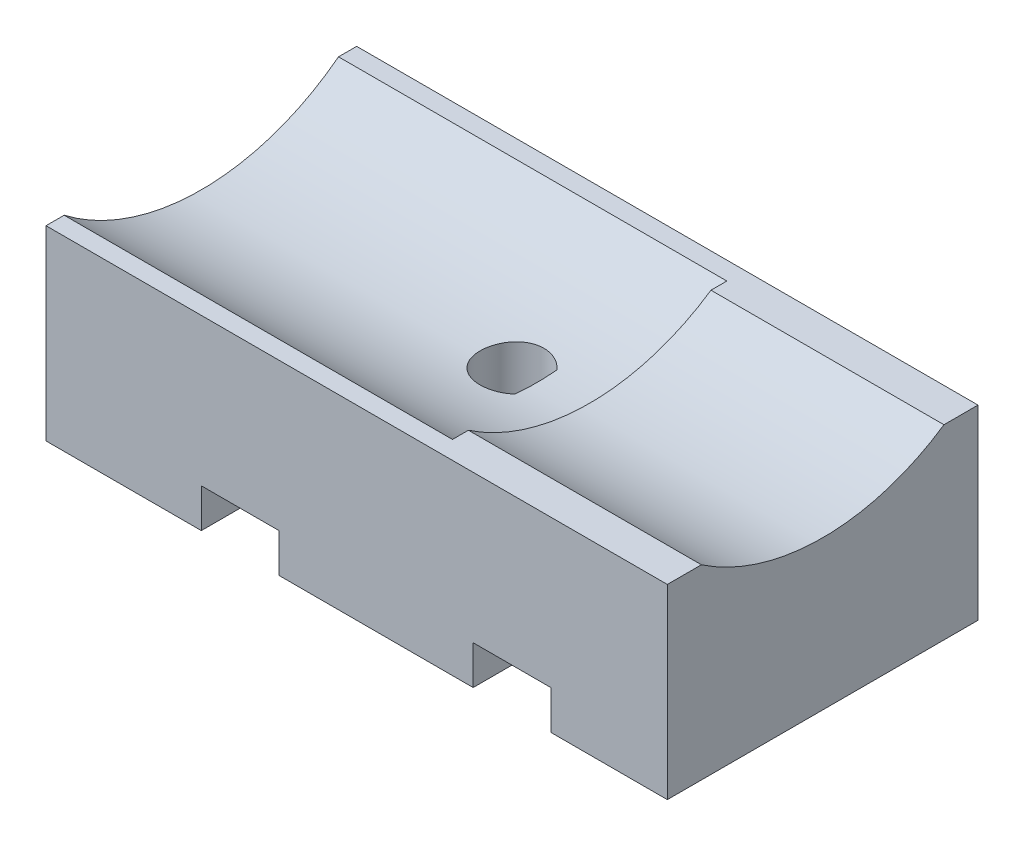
ISO-10303-21;
HEADER;
FILE_DESCRIPTION(('STEP AP214'),'2;1');
FILE_NAME('part.step','',(''),(''),'','','');
FILE_SCHEMA(('AUTOMOTIVE_DESIGN { 1 0 10303 214 1 1 1 1 }'));
ENDSEC;
DATA;
#1=APPLICATION_CONTEXT('core data for automotive mechanical design processes');
#2=APPLICATION_PROTOCOL_DEFINITION('international standard','automotive_design',2000,#1);
#3=PRODUCT_CONTEXT('',#1,'mechanical');
#4=PRODUCT('Part','Part','',(#3));
#5=PRODUCT_RELATED_PRODUCT_CATEGORY('part','',(#4));
#6=PRODUCT_DEFINITION_FORMATION('','',#4);
#7=PRODUCT_DEFINITION_CONTEXT('part definition',#1,'design');
#8=PRODUCT_DEFINITION('design','',#6,#7);
#9=PRODUCT_DEFINITION_SHAPE('','',#8);
#10=(LENGTH_UNIT() NAMED_UNIT(*) SI_UNIT(.MILLI.,.METRE.));
#11=(NAMED_UNIT(*) PLANE_ANGLE_UNIT() SI_UNIT($,.RADIAN.));
#12=(NAMED_UNIT(*) SI_UNIT($,.STERADIAN.) SOLID_ANGLE_UNIT());
#13=UNCERTAINTY_MEASURE_WITH_UNIT(LENGTH_MEASURE(1.E-05),#10,'distance_accuracy_value','');
#14=(GEOMETRIC_REPRESENTATION_CONTEXT(3) GLOBAL_UNCERTAINTY_ASSIGNED_CONTEXT((#13)) GLOBAL_UNIT_ASSIGNED_CONTEXT((#10,
#11,#12)) REPRESENTATION_CONTEXT('',''));
#15=CARTESIAN_POINT('',(0.,0.,0.));
#16=DIRECTION('',(0.,0.,1.));
#17=DIRECTION('',(1.,0.,0.));
#18=AXIS2_PLACEMENT_3D('',#15,#16,#17);
#19=CARTESIAN_POINT('',(-20.,12.,-10.));
#20=DIRECTION('',(0.,1.,0.));
#21=DIRECTION('',(-1.,0.,0.));
#22=AXIS2_PLACEMENT_3D('',#19,#20,#21);
#23=PLANE('',#22);
#24=DIRECTION('',(0.,0.,-1.));
#25=VECTOR('',#24,1.);
#26=CARTESIAN_POINT('',(5.,12.,-10.));
#27=LINE('',#26,#25);
#28=CARTESIAN_POINT('',(5.,12.,-7.80768851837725));
#29=VERTEX_POINT('',#28);
#30=CARTESIAN_POINT('',(5.,12.,-8.83176086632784));
#31=VERTEX_POINT('',#30);
#32=EDGE_CURVE('E328',#29,#31,#27,.T.);
#33=ORIENTED_EDGE('',*,*,#32,.F.);
#34=DIRECTION('',(-1.,0.,0.));
#35=VECTOR('',#34,1.);
#36=CARTESIAN_POINT('',(20.,12.,-7.80768851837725));
#37=LINE('',#36,#35);
#38=CARTESIAN_POINT('',(20.,12.,-7.80768851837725));
#39=VERTEX_POINT('',#38);
#40=EDGE_CURVE('E244',#29,#39,#37,.F.);
#41=ORIENTED_EDGE('',*,*,#40,.T.);
#42=DIRECTION('',(0.,0.,1.));
#43=VECTOR('',#42,1.);
#44=CARTESIAN_POINT('',(20.,12.,-10.));
#45=LINE('',#44,#43);
#46=CARTESIAN_POINT('',(20.,12.,-10.));
#47=VERTEX_POINT('',#46);
#48=EDGE_CURVE('E387',#47,#39,#45,.T.);
#49=ORIENTED_EDGE('',*,*,#48,.F.);
#50=DIRECTION('',(-1.,0.,0.));
#51=VECTOR('',#50,1.);
#52=CARTESIAN_POINT('',(-20.,12.,-10.));
#53=LINE('',#52,#51);
#54=CARTESIAN_POINT('',(-20.,12.,-10.));
#55=VERTEX_POINT('',#54);
#56=EDGE_CURVE('E384',#47,#55,#53,.T.);
#57=ORIENTED_EDGE('',*,*,#56,.T.);
#58=DIRECTION('',(0.,0.,1.));
#59=VECTOR('',#58,1.);
#60=CARTESIAN_POINT('',(-20.,12.,-10.));
#61=LINE('',#60,#59);
#62=CARTESIAN_POINT('',(-20.,12.,-8.83176086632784));
#63=VERTEX_POINT('',#62);
#64=EDGE_CURVE('E315',#55,#63,#61,.T.);
#65=ORIENTED_EDGE('',*,*,#64,.T.);
#66=DIRECTION('',(-1.,0.,0.));
#67=VECTOR('',#66,1.);
#68=CARTESIAN_POINT('',(5.,12.,-8.83176086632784));
#69=LINE('',#68,#67);
#70=EDGE_CURVE('E407',#63,#31,#69,.F.);
#71=ORIENTED_EDGE('',*,*,#70,.T.);
#72=EDGE_LOOP('',(#33,#41,#49,#57,#65,#71));
#73=FACE_BOUND('',#72,.T.);
#74=ADVANCED_FACE('F32',(#73),#23,.T.);
#75=CARTESIAN_POINT('',(20.,12.,7.80768851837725));
#76=VERTEX_POINT('',#75);
#77=CARTESIAN_POINT('',(20.,12.,10.));
#78=VERTEX_POINT('',#77);
#79=EDGE_CURVE('E389',#76,#78,#45,.T.);
#80=ORIENTED_EDGE('',*,*,#79,.F.);
#81=DIRECTION('',(-1.,0.,0.));
#82=VECTOR('',#81,1.);
#83=CARTESIAN_POINT('',(20.,12.,7.80768851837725));
#84=LINE('',#83,#82);
#85=CARTESIAN_POINT('',(5.,12.,7.80768851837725));
#86=VERTEX_POINT('',#85);
#87=EDGE_CURVE('E241',#76,#86,#84,.T.);
#88=ORIENTED_EDGE('',*,*,#87,.T.);
#89=CARTESIAN_POINT('',(5.,12.,8.83176086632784));
#90=VERTEX_POINT('',#89);
#91=EDGE_CURVE('E329',#90,#86,#27,.T.);
#92=ORIENTED_EDGE('',*,*,#91,.F.);
#93=DIRECTION('',(-1.,0.,0.));
#94=VECTOR('',#93,1.);
#95=CARTESIAN_POINT('',(5.,12.,8.83176086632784));
#96=LINE('',#95,#94);
#97=CARTESIAN_POINT('',(-20.,12.,8.83176086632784));
#98=VERTEX_POINT('',#97);
#99=EDGE_CURVE('E262',#90,#98,#96,.T.);
#100=ORIENTED_EDGE('',*,*,#99,.T.);
#101=CARTESIAN_POINT('',(-20.,12.,10.));
#102=VERTEX_POINT('',#101);
#103=EDGE_CURVE('E320',#98,#102,#61,.T.);
#104=ORIENTED_EDGE('',*,*,#103,.T.);
#105=DIRECTION('',(-1.,0.,0.));
#106=VECTOR('',#105,1.);
#107=CARTESIAN_POINT('',(-20.,12.,10.));
#108=LINE('',#107,#106);
#109=EDGE_CURVE('E370',#78,#102,#108,.T.);
#110=ORIENTED_EDGE('',*,*,#109,.F.);
#111=EDGE_LOOP('',(#80,#88,#92,#100,#104,#110));
#112=FACE_BOUND('',#111,.T.);
#113=ADVANCED_FACE('F285',(#112),#23,.T.);
#114=CARTESIAN_POINT('',(0.,12.,0.));
#115=DIRECTION('',(0.,-1.,0.));
#116=DIRECTION('',(0.,0.,-1.));
#117=AXIS2_PLACEMENT_3D('',#114,#115,#116);
#118=CYLINDRICAL_SURFACE('',#117,2.05);
#119=DIRECTION('',(0.,-1.,0.));
#120=VECTOR('',#119,1.);
#121=CARTESIAN_POINT('',(1.55,12.,-1.34164078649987));
#122=LINE('',#121,#120);
#123=CARTESIAN_POINT('',(1.55,9.06220238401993,-1.34164078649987));
#124=VERTEX_POINT('',#123);
#125=CARTESIAN_POINT('',(1.55,0.,-1.34164078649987));
#126=VERTEX_POINT('',#125);
#127=EDGE_CURVE('E405',#124,#126,#122,.T.);
#128=ORIENTED_EDGE('',*,*,#127,.F.);
#129=CARTESIAN_POINT('',(1.55,9.06220238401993,-1.34164078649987));
#130=CARTESIAN_POINT('',(1.51226440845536,9.06625320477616,-1.38523559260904));
#131=CARTESIAN_POINT('',(1.47271010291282,9.0703535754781,-1.42721478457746));
#132=CARTESIAN_POINT('',(1.39020905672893,9.07854062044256,-1.50769473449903));
#133=CARTESIAN_POINT('',(1.34726240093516,9.08262729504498,-1.54619557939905));
#134=CARTESIAN_POINT('',(1.21380729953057,9.09468805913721,-1.65602334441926));
#135=CARTESIAN_POINT('',(1.11859022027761,9.10247334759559,-1.7217833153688));
#136=CARTESIAN_POINT('',(0.918370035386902,9.11664398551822,-1.8364174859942));
#137=CARTESIAN_POINT('',(0.813361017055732,9.12302848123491,-1.88528139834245));
#138=CARTESIAN_POINT('',(0.596544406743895,9.13366215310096,-1.96467531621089));
#139=CARTESIAN_POINT('',(0.4847391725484,9.13791206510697,-1.99521164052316));
#140=CARTESIAN_POINT('',(0.258184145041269,9.14376739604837,-2.03691749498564));
#141=CARTESIAN_POINT('',(0.14345535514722,9.14538811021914,-2.0481990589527));
#142=CARTESIAN_POINT('',(-0.0862961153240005,9.14584550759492,-2.05140248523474));
#143=CARTESIAN_POINT('',(-0.201318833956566,9.14468180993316,-2.04332169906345));
#144=CARTESIAN_POINT('',(-0.427604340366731,9.1397206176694,-2.00815410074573));
#145=CARTESIAN_POINT('',(-0.538886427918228,9.13593996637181,-1.98118882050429));
#146=CARTESIAN_POINT('',(-0.755329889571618,9.12619309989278,-1.90918444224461));
#147=CARTESIAN_POINT('',(-0.860491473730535,9.12022695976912,-1.8641459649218));
#148=CARTESIAN_POINT('',(-1.06229658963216,9.10674550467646,-1.75702599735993));
#149=CARTESIAN_POINT('',(-1.15889578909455,9.09922273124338,-1.69486195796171));
#150=CARTESIAN_POINT('',(-1.34035120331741,9.08348670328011,-1.55533257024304));
#151=CARTESIAN_POINT('',(-1.42520650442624,9.07527339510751,-1.47796604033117));
#152=CARTESIAN_POINT('',(-1.5815075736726,9.05899729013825,-1.30944698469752));
#153=CARTESIAN_POINT('',(-1.65283379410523,9.05093635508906,-1.21818334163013));
#154=CARTESIAN_POINT('',(-1.77916145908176,9.03594220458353,-1.02489681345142));
#155=CARTESIAN_POINT('',(-1.83416312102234,9.02900897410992,-0.92287407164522));
#156=CARTESIAN_POINT('',(-1.92619905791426,9.0170565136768,-0.711040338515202));
#157=CARTESIAN_POINT('',(-1.96325203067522,9.01203529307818,-0.601237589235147));
#158=CARTESIAN_POINT('',(-2.01836546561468,9.0044646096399,-0.37688413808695));
#159=CARTESIAN_POINT('',(-2.03642707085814,9.00191499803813,-0.2623337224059));
#160=CARTESIAN_POINT('',(-2.05293570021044,8.99958697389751,-0.0328156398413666));
#161=CARTESIAN_POINT('',(-2.05155380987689,8.9997843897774,0.0821395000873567));
#162=CARTESIAN_POINT('',(-2.02963399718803,9.00286928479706,0.310169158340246));
#163=CARTESIAN_POINT('',(-2.00909641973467,9.00575671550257,0.423243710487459));
#164=CARTESIAN_POINT('',(-1.94956875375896,9.01388735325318,0.643981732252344));
#165=CARTESIAN_POINT('',(-1.91063193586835,9.01912375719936,0.751659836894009));
#166=CARTESIAN_POINT('',(-1.81545864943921,9.03137277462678,0.95896839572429));
#167=CARTESIAN_POINT('',(-1.75922136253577,9.03838547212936,1.05859846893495));
#168=CARTESIAN_POINT('',(-1.6305538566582,9.05347422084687,1.24778933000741));
#169=CARTESIAN_POINT('',(-1.55800642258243,9.06155778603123,1.33726979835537));
#170=CARTESIAN_POINT('',(-1.39897953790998,9.07785029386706,1.50284182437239));
#171=CARTESIAN_POINT('',(-1.31249942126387,9.08605924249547,1.57893274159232));
#172=CARTESIAN_POINT('',(-1.12739317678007,9.10173716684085,1.71605202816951));
#173=CARTESIAN_POINT('',(-1.02869292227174,9.10920107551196,1.77698097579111));
#174=CARTESIAN_POINT('',(-0.82235273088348,9.12247658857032,1.88138341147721));
#175=CARTESIAN_POINT('',(-0.714713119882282,9.12828825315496,1.92485753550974));
#176=CARTESIAN_POINT('',(-0.494062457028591,9.1375658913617,1.99290482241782));
#177=CARTESIAN_POINT('',(-0.381078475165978,9.14104256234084,2.0175642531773));
#178=CARTESIAN_POINT('',(-0.152529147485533,9.14528931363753,2.04756340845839));
#179=CARTESIAN_POINT('',(-0.0369640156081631,9.14605961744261,2.05290472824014));
#180=CARTESIAN_POINT('',(0.192407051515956,9.1448100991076,2.04414767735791));
#181=CARTESIAN_POINT('',(0.306219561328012,9.14281430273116,2.03021670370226));
#182=CARTESIAN_POINT('',(0.529894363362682,9.13630328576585,1.98362354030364));
#183=CARTESIAN_POINT('',(0.639755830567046,9.13178754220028,1.95095746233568));
#184=CARTESIAN_POINT('',(0.852561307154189,9.12074282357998,1.86781061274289));
#185=CARTESIAN_POINT('',(0.95549551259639,9.11421106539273,1.81730519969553));
#186=CARTESIAN_POINT('',(1.15140181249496,9.09987195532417,1.69993572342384));
#187=CARTESIAN_POINT('',(1.24438390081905,9.09206590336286,1.63308829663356));
#188=CARTESIAN_POINT('',(1.37027729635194,9.0804429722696,1.52561709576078));
#189=CARTESIAN_POINT('',(1.40819175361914,9.07678342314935,1.49068915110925));
#190=CARTESIAN_POINT('',(1.48121578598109,9.06947027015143,1.41814637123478));
#191=CARTESIAN_POINT('',(1.51633047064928,9.0658166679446,1.38053667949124));
#192=CARTESIAN_POINT('',(1.55,9.06220238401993,1.34164078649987));
#193=B_SPLINE_CURVE_WITH_KNOTS('',3,(#129,#130,#131,#132,#133,#134,#135,#136,#137,#138,#139,
#140,#141,#142,#143,#144,#145,#146,#147,#148,#149,#150,#151,#152,#153,#154,#155,#156,#157,#158,
#159,#160,#161,#162,#163,#164,#165,#166,#167,#168,#169,#170,#171,#172,#173,#174,#175,#176,#177,
#178,#179,#180,#181,#182,#183,#184,#185,#186,#187,#188,#189,#190,#191,#192),.UNSPECIFIED.,.F.,
.F.,(4,2,2,2,2,2,2,2,2,2,2,2,2,2,2,2,2,2,2,2,2,2,2,2,2,2,2,2,2,2,2,4),(0.,0.173295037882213,
0.346585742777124,0.692743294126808,1.03911123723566,1.38535969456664,1.72958654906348,
2.0738604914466,2.41593896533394,2.75800569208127,3.10175101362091,3.44552306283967,
3.79220411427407,4.13888054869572,4.48519505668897,4.83148871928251,5.17473722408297,
5.51797954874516,5.86023412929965,6.20250490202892,6.54731888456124,6.89214935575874,
7.23918469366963,7.58620738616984,7.93162920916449,8.27702250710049,8.61943452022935,
8.9619176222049,9.30487565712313,9.64748599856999,9.80240530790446,9.95703509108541),.UNSPECIFIED.);
#194=CARTESIAN_POINT('',(1.55,9.06220238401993,1.34164078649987));
#195=VERTEX_POINT('',#194);
#196=EDGE_CURVE('E253',#124,#195,#193,.T.);
#197=ORIENTED_EDGE('',*,*,#196,.T.);
#198=DIRECTION('',(0.,-1.,0.));
#199=VECTOR('',#198,1.);
#200=CARTESIAN_POINT('',(1.55,12.,1.34164078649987));
#201=LINE('',#200,#199);
#202=CARTESIAN_POINT('',(1.55,0.,1.34164078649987));
#203=VERTEX_POINT('',#202);
#204=EDGE_CURVE('E404',#195,#203,#201,.T.);
#205=ORIENTED_EDGE('',*,*,#204,.T.);
#206=CARTESIAN_POINT('',(0.,0.,0.));
#207=DIRECTION('',(0.,-1.,0.));
#208=DIRECTION('',(0.,0.,-1.));
#209=AXIS2_PLACEMENT_3D('',#206,#207,#208);
#210=CIRCLE('',#209,2.05);
#211=EDGE_CURVE('E314',#126,#203,#210,.F.);
#212=ORIENTED_EDGE('',*,*,#211,.F.);
#213=EDGE_LOOP('',(#128,#197,#205,#212));
#214=FACE_BOUND('',#213,.T.);
#215=ADVANCED_FACE('F264',(#214),#118,.F.);
#216=CARTESIAN_POINT('',(-20.,0.,-10.));
#217=DIRECTION('',(0.,-1.,0.));
#218=DIRECTION('',(1.,0.,0.));
#219=AXIS2_PLACEMENT_3D('',#216,#217,#218);
#220=PLANE('',#219);
#221=DIRECTION('',(0.,0.,1.));
#222=VECTOR('',#221,1.);
#223=CARTESIAN_POINT('',(12.5,0.,-10.));
#224=LINE('',#223,#222);
#225=CARTESIAN_POINT('',(12.5,0.,-10.));
#226=VERTEX_POINT('',#225);
#227=CARTESIAN_POINT('',(12.5,0.,-6.42261628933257));
#228=VERTEX_POINT('',#227);
#229=EDGE_CURVE('E210',#226,#228,#224,.T.);
#230=ORIENTED_EDGE('',*,*,#229,.F.);
#231=DIRECTION('',(1.,0.,0.));
#232=VECTOR('',#231,1.);
#233=CARTESIAN_POINT('',(-20.,0.,-10.));
#234=LINE('',#233,#232);
#235=CARTESIAN_POINT('',(20.,0.,-10.));
#236=VERTEX_POINT('',#235);
#237=EDGE_CURVE('E376',#226,#236,#234,.T.);
#238=ORIENTED_EDGE('',*,*,#237,.T.);
#239=DIRECTION('',(0.,0.,1.));
#240=VECTOR('',#239,1.);
#241=CARTESIAN_POINT('',(20.,0.,-10.));
#242=LINE('',#241,#240);
#243=CARTESIAN_POINT('',(20.,0.,10.));
#244=VERTEX_POINT('',#243);
#245=EDGE_CURVE('E390',#236,#244,#242,.T.);
#246=ORIENTED_EDGE('',*,*,#245,.T.);
#247=DIRECTION('',(1.,0.,0.));
#248=VECTOR('',#247,1.);
#249=CARTESIAN_POINT('',(-20.,0.,10.));
#250=LINE('',#249,#248);
#251=CARTESIAN_POINT('',(12.5,0.,10.));
#252=VERTEX_POINT('',#251);
#253=EDGE_CURVE('E360',#252,#244,#250,.T.);
#254=ORIENTED_EDGE('',*,*,#253,.F.);
#255=CARTESIAN_POINT('',(12.5,0.,6.42261628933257));
#256=VERTEX_POINT('',#255);
#257=EDGE_CURVE('E208',#256,#252,#224,.T.);
#258=ORIENTED_EDGE('',*,*,#257,.F.);
#259=DIRECTION('',(-1.,0.,0.));
#260=VECTOR('',#259,1.);
#261=CARTESIAN_POINT('',(12.5,0.,6.42261628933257));
#262=LINE('',#261,#260);
#263=CARTESIAN_POINT('',(7.49999999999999,0.,6.42261628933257));
#264=VERTEX_POINT('',#263);
#265=EDGE_CURVE('E202',#256,#264,#262,.T.);
#266=ORIENTED_EDGE('',*,*,#265,.T.);
#267=DIRECTION('',(0.,0.,1.));
#268=VECTOR('',#267,1.);
#269=CARTESIAN_POINT('',(7.49999999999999,0.,-10.));
#270=LINE('',#269,#268);
#271=CARTESIAN_POINT('',(7.49999999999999,0.,10.));
#272=VERTEX_POINT('',#271);
#273=EDGE_CURVE('E186',#264,#272,#270,.T.);
#274=ORIENTED_EDGE('',*,*,#273,.T.);
#275=CARTESIAN_POINT('',(-5.00000000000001,0.,10.));
#276=VERTEX_POINT('',#275);
#277=EDGE_CURVE('E357',#276,#272,#250,.T.);
#278=ORIENTED_EDGE('',*,*,#277,.F.);
#279=DIRECTION('',(0.,0.,-1.));
#280=VECTOR('',#279,1.);
#281=CARTESIAN_POINT('',(-5.,0.,-10.));
#282=LINE('',#281,#280);
#283=CARTESIAN_POINT('',(-5.,0.,6.42261628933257));
#284=VERTEX_POINT('',#283);
#285=EDGE_CURVE('E220',#276,#284,#282,.T.);
#286=ORIENTED_EDGE('',*,*,#285,.T.);
#287=DIRECTION('',(1.,0.,0.));
#288=VECTOR('',#287,1.);
#289=CARTESIAN_POINT('',(-10.,0.,6.42261628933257));
#290=LINE('',#289,#288);
#291=CARTESIAN_POINT('',(-10.,0.,6.42261628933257));
#292=VERTEX_POINT('',#291);
#293=EDGE_CURVE('E229',#292,#284,#290,.T.);
#294=ORIENTED_EDGE('',*,*,#293,.F.);
#295=DIRECTION('',(0.,0.,-1.));
#296=VECTOR('',#295,1.);
#297=CARTESIAN_POINT('',(-10.,0.,-10.));
#298=LINE('',#297,#296);
#299=CARTESIAN_POINT('',(-10.,0.,10.));
#300=VERTEX_POINT('',#299);
#301=EDGE_CURVE('E233',#300,#292,#298,.T.);
#302=ORIENTED_EDGE('',*,*,#301,.F.);
#303=CARTESIAN_POINT('',(-20.,0.,10.));
#304=VERTEX_POINT('',#303);
#305=EDGE_CURVE('E359',#304,#300,#250,.T.);
#306=ORIENTED_EDGE('',*,*,#305,.F.);
#307=DIRECTION('',(0.,0.,1.));
#308=VECTOR('',#307,1.);
#309=CARTESIAN_POINT('',(-20.,0.,-10.));
#310=LINE('',#309,#308);
#311=CARTESIAN_POINT('',(-20.,0.,-10.));
#312=VERTEX_POINT('',#311);
#313=EDGE_CURVE('E323',#312,#304,#310,.T.);
#314=ORIENTED_EDGE('',*,*,#313,.F.);
#315=CARTESIAN_POINT('',(-10.,0.,-10.));
#316=VERTEX_POINT('',#315);
#317=EDGE_CURVE('E377',#312,#316,#234,.T.);
#318=ORIENTED_EDGE('',*,*,#317,.T.);
#319=CARTESIAN_POINT('',(-10.,0.,-6.42261628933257));
#320=VERTEX_POINT('',#319);
#321=EDGE_CURVE('E236',#320,#316,#298,.T.);
#322=ORIENTED_EDGE('',*,*,#321,.F.);
#323=DIRECTION('',(1.,0.,0.));
#324=VECTOR('',#323,1.);
#325=CARTESIAN_POINT('',(-10.,0.,-6.42261628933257));
#326=LINE('',#325,#324);
#327=CARTESIAN_POINT('',(-5.,0.,-6.42261628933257));
#328=VERTEX_POINT('',#327);
#329=EDGE_CURVE('E231',#328,#320,#326,.F.);
#330=ORIENTED_EDGE('',*,*,#329,.F.);
#331=CARTESIAN_POINT('',(-5.,0.,-10.));
#332=VERTEX_POINT('',#331);
#333=EDGE_CURVE('E224',#328,#332,#282,.T.);
#334=ORIENTED_EDGE('',*,*,#333,.T.);
#335=CARTESIAN_POINT('',(7.49999999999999,0.,-10.));
#336=VERTEX_POINT('',#335);
#337=EDGE_CURVE('E381',#332,#336,#234,.T.);
#338=ORIENTED_EDGE('',*,*,#337,.T.);
#339=CARTESIAN_POINT('',(7.49999999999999,0.,-6.42261628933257));
#340=VERTEX_POINT('',#339);
#341=EDGE_CURVE('E47',#336,#340,#270,.T.);
#342=ORIENTED_EDGE('',*,*,#341,.T.);
#343=DIRECTION('',(-1.,0.,0.));
#344=VECTOR('',#343,1.);
#345=CARTESIAN_POINT('',(12.5,0.,-6.42261628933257));
#346=LINE('',#345,#344);
#347=EDGE_CURVE('E194',#340,#228,#346,.F.);
#348=ORIENTED_EDGE('',*,*,#347,.T.);
#349=EDGE_LOOP('',(#230,#238,#246,#254,#258,#266,#274,#278,#286,#294,#302,#306,#314,#318,#322,
#330,#334,#338,#342,#348));
#350=FACE_BOUND('',#349,.T.);
#351=DIRECTION('',(0.,0.,1.));
#352=VECTOR('',#351,1.);
#353=CARTESIAN_POINT('',(1.55,0.,-10.));
#354=LINE('',#353,#352);
#355=EDGE_CURVE('E312',#203,#126,#354,.F.);
#356=ORIENTED_EDGE('',*,*,#355,.T.);
#357=ORIENTED_EDGE('',*,*,#211,.T.);
#358=EDGE_LOOP('',(#356,#357));
#359=FACE_BOUND('',#358,.T.);
#360=ADVANCED_FACE('F298',(#350,#359),#220,.T.);
#361=CARTESIAN_POINT('',(-20.,12.,-10.));
#362=DIRECTION('',(-1.,0.,0.));
#363=DIRECTION('',(0.,0.,1.));
#364=AXIS2_PLACEMENT_3D('',#361,#362,#363);
#365=PLANE('',#364);
#366=ORIENTED_EDGE('',*,*,#103,.F.);
#367=CARTESIAN_POINT('',(-20.,23.5,0.));
#368=DIRECTION('',(1.,0.,0.));
#369=DIRECTION('',(0.,0.,-1.));
#370=AXIS2_PLACEMENT_3D('',#367,#368,#369);
#371=CIRCLE('',#370,14.5);
#372=EDGE_CURVE('E247',#98,#63,#371,.T.);
#373=ORIENTED_EDGE('',*,*,#372,.T.);
#374=ORIENTED_EDGE('',*,*,#64,.F.);
#375=DIRECTION('',(0.,-1.,0.));
#376=VECTOR('',#375,1.);
#377=CARTESIAN_POINT('',(-20.,12.,-10.));
#378=LINE('',#377,#376);
#379=EDGE_CURVE('E373',#55,#312,#378,.T.);
#380=ORIENTED_EDGE('',*,*,#379,.T.);
#381=ORIENTED_EDGE('',*,*,#313,.T.);
#382=DIRECTION('',(0.,-1.,0.));
#383=VECTOR('',#382,1.);
#384=CARTESIAN_POINT('',(-20.,12.,10.));
#385=LINE('',#384,#383);
#386=EDGE_CURVE('E364',#102,#304,#385,.T.);
#387=ORIENTED_EDGE('',*,*,#386,.F.);
#388=EDGE_LOOP('',(#366,#373,#374,#380,#381,#387));
#389=FACE_BOUND('',#388,.T.);
#390=ADVANCED_FACE('F34',(#389),#365,.T.);
#391=CARTESIAN_POINT('',(20.,12.,-10.));
#392=DIRECTION('',(1.,0.,0.));
#393=DIRECTION('',(0.,1.,0.));
#394=AXIS2_PLACEMENT_3D('',#391,#392,#393);
#395=PLANE('',#394);
#396=ORIENTED_EDGE('',*,*,#48,.T.);
#397=CARTESIAN_POINT('',(20.,23.5,0.));
#398=DIRECTION('',(1.,0.,0.));
#399=DIRECTION('',(0.,0.,-1.));
#400=AXIS2_PLACEMENT_3D('',#397,#398,#399);
#401=CIRCLE('',#400,13.9);
#402=EDGE_CURVE('E239',#76,#39,#401,.T.);
#403=ORIENTED_EDGE('',*,*,#402,.F.);
#404=ORIENTED_EDGE('',*,*,#79,.T.);
#405=DIRECTION('',(0.,1.,0.));
#406=VECTOR('',#405,1.);
#407=CARTESIAN_POINT('',(20.,12.,10.));
#408=LINE('',#407,#406);
#409=EDGE_CURVE('E363',#244,#78,#408,.T.);
#410=ORIENTED_EDGE('',*,*,#409,.F.);
#411=ORIENTED_EDGE('',*,*,#245,.F.);
#412=DIRECTION('',(0.,1.,0.));
#413=VECTOR('',#412,1.);
#414=CARTESIAN_POINT('',(20.,12.,-10.));
#415=LINE('',#414,#413);
#416=EDGE_CURVE('E380',#236,#47,#415,.T.);
#417=ORIENTED_EDGE('',*,*,#416,.T.);
#418=EDGE_LOOP('',(#396,#403,#404,#410,#411,#417));
#419=FACE_BOUND('',#418,.T.);
#420=ADVANCED_FACE('F295',(#419),#395,.T.);
#421=CARTESIAN_POINT('',(0.,0.,-10.));
#422=DIRECTION('',(0.,0.,1.));
#423=DIRECTION('',(1.,0.,0.));
#424=AXIS2_PLACEMENT_3D('',#421,#422,#423);
#425=PLANE('',#424);
#426=ORIENTED_EDGE('',*,*,#237,.F.);
#427=DIRECTION('',(0.,1.,0.));
#428=VECTOR('',#427,1.);
#429=CARTESIAN_POINT('',(12.5,0.,-10.));
#430=LINE('',#429,#428);
#431=CARTESIAN_POINT('',(12.5,2.5,-10.));
#432=VERTEX_POINT('',#431);
#433=EDGE_CURVE('E200',#226,#432,#430,.T.);
#434=ORIENTED_EDGE('',*,*,#433,.T.);
#435=DIRECTION('',(-1.,0.,0.));
#436=VECTOR('',#435,1.);
#437=CARTESIAN_POINT('',(12.5,2.5,-10.));
#438=LINE('',#437,#436);
#439=CARTESIAN_POINT('',(7.49999999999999,2.5,-10.));
#440=VERTEX_POINT('',#439);
#441=EDGE_CURVE('E191',#440,#432,#438,.F.);
#442=ORIENTED_EDGE('',*,*,#441,.F.);
#443=DIRECTION('',(0.,1.,0.));
#444=VECTOR('',#443,1.);
#445=CARTESIAN_POINT('',(7.49999999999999,0.,-10.));
#446=LINE('',#445,#444);
#447=EDGE_CURVE('E178',#336,#440,#446,.T.);
#448=ORIENTED_EDGE('',*,*,#447,.F.);
#449=ORIENTED_EDGE('',*,*,#337,.F.);
#450=DIRECTION('',(0.,-1.,0.));
#451=VECTOR('',#450,1.);
#452=CARTESIAN_POINT('',(-5.,0.,-10.));
#453=LINE('',#452,#451);
#454=CARTESIAN_POINT('',(-5.,2.5,-10.));
#455=VERTEX_POINT('',#454);
#456=EDGE_CURVE('E223',#455,#332,#453,.T.);
#457=ORIENTED_EDGE('',*,*,#456,.F.);
#458=DIRECTION('',(1.,0.,0.));
#459=VECTOR('',#458,1.);
#460=CARTESIAN_POINT('',(-10.,2.5,-10.));
#461=LINE('',#460,#459);
#462=CARTESIAN_POINT('',(-10.,2.5,-10.));
#463=VERTEX_POINT('',#462);
#464=EDGE_CURVE('E226',#455,#463,#461,.F.);
#465=ORIENTED_EDGE('',*,*,#464,.T.);
#466=DIRECTION('',(0.,-1.,0.));
#467=VECTOR('',#466,1.);
#468=CARTESIAN_POINT('',(-10.,0.,-10.));
#469=LINE('',#468,#467);
#470=EDGE_CURVE('E235',#463,#316,#469,.T.);
#471=ORIENTED_EDGE('',*,*,#470,.T.);
#472=ORIENTED_EDGE('',*,*,#317,.F.);
#473=ORIENTED_EDGE('',*,*,#379,.F.);
#474=ORIENTED_EDGE('',*,*,#56,.F.);
#475=ORIENTED_EDGE('',*,*,#416,.F.);
#476=EDGE_LOOP('',(#426,#434,#442,#448,#449,#457,#465,#471,#472,#473,#474,#475));
#477=FACE_BOUND('',#476,.T.);
#478=ADVANCED_FACE('F199',(#477),#425,.F.);
#479=CARTESIAN_POINT('',(0.,0.,10.));
#480=DIRECTION('',(0.,0.,1.));
#481=DIRECTION('',(1.,0.,0.));
#482=AXIS2_PLACEMENT_3D('',#479,#480,#481);
#483=PLANE('',#482);
#484=DIRECTION('',(0.,1.,0.));
#485=VECTOR('',#484,1.);
#486=CARTESIAN_POINT('',(12.5,0.,10.));
#487=LINE('',#486,#485);
#488=CARTESIAN_POINT('',(12.5,2.5,10.));
#489=VERTEX_POINT('',#488);
#490=EDGE_CURVE('E11',#252,#489,#487,.T.);
#491=ORIENTED_EDGE('',*,*,#490,.F.);
#492=ORIENTED_EDGE('',*,*,#253,.T.);
#493=ORIENTED_EDGE('',*,*,#409,.T.);
#494=ORIENTED_EDGE('',*,*,#109,.T.);
#495=ORIENTED_EDGE('',*,*,#386,.T.);
#496=ORIENTED_EDGE('',*,*,#305,.T.);
#497=DIRECTION('',(0.,-1.,0.));
#498=VECTOR('',#497,1.);
#499=CARTESIAN_POINT('',(-10.,0.,10.));
#500=LINE('',#499,#498);
#501=CARTESIAN_POINT('',(-10.,2.5,10.));
#502=VERTEX_POINT('',#501);
#503=EDGE_CURVE('E339',#502,#300,#500,.T.);
#504=ORIENTED_EDGE('',*,*,#503,.F.);
#505=DIRECTION('',(1.,0.,0.));
#506=VECTOR('',#505,1.);
#507=CARTESIAN_POINT('',(-10.,2.5,10.));
#508=LINE('',#507,#506);
#509=CARTESIAN_POINT('',(-5.,2.5,10.));
#510=VERTEX_POINT('',#509);
#511=EDGE_CURVE('E337',#510,#502,#508,.F.);
#512=ORIENTED_EDGE('',*,*,#511,.F.);
#513=DIRECTION('',(0.,-1.,0.));
#514=VECTOR('',#513,1.);
#515=CARTESIAN_POINT('',(-5.,0.,10.));
#516=LINE('',#515,#514);
#517=EDGE_CURVE('E334',#510,#276,#516,.T.);
#518=ORIENTED_EDGE('',*,*,#517,.T.);
#519=ORIENTED_EDGE('',*,*,#277,.T.);
#520=DIRECTION('',(0.,1.,0.));
#521=VECTOR('',#520,1.);
#522=CARTESIAN_POINT('',(7.49999999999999,0.,10.));
#523=LINE('',#522,#521);
#524=CARTESIAN_POINT('',(7.49999999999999,2.5,10.));
#525=VERTEX_POINT('',#524);
#526=EDGE_CURVE('E341',#272,#525,#523,.T.);
#527=ORIENTED_EDGE('',*,*,#526,.T.);
#528=DIRECTION('',(-1.,0.,0.));
#529=VECTOR('',#528,1.);
#530=CARTESIAN_POINT('',(12.5,2.5,10.));
#531=LINE('',#530,#529);
#532=EDGE_CURVE('E40',#525,#489,#531,.F.);
#533=ORIENTED_EDGE('',*,*,#532,.T.);
#534=EDGE_LOOP('',(#491,#492,#493,#494,#495,#496,#504,#512,#518,#519,#527,#533));
#535=FACE_BOUND('',#534,.T.);
#536=ADVANCED_FACE('F277',(#535),#483,.T.);
#537=CARTESIAN_POINT('',(1.55,12.,-1.34164078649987));
#538=DIRECTION('',(-1.,0.,0.));
#539=DIRECTION('',(0.,0.,1.));
#540=AXIS2_PLACEMENT_3D('',#537,#538,#539);
#541=PLANE('',#540);
#542=ORIENTED_EDGE('',*,*,#204,.F.);
#543=CARTESIAN_POINT('',(1.55,23.5,0.));
#544=DIRECTION('',(-1.,0.,0.));
#545=DIRECTION('',(0.,0.,1.));
#546=AXIS2_PLACEMENT_3D('',#543,#544,#545);
#547=CIRCLE('',#546,14.5);
#548=EDGE_CURVE('E317',#195,#124,#547,.F.);
#549=ORIENTED_EDGE('',*,*,#548,.T.);
#550=ORIENTED_EDGE('',*,*,#127,.T.);
#551=ORIENTED_EDGE('',*,*,#355,.F.);
#552=EDGE_LOOP('',(#542,#549,#550,#551));
#553=FACE_BOUND('',#552,.T.);
#554=ADVANCED_FACE('F273',(#553),#541,.T.);
#555=CARTESIAN_POINT('',(5.,23.5,0.));
#556=DIRECTION('',(-1.,0.,0.));
#557=DIRECTION('',(0.,0.,1.));
#558=AXIS2_PLACEMENT_3D('',#555,#556,#557);
#559=CYLINDRICAL_SURFACE('',#558,14.5);
#560=ORIENTED_EDGE('',*,*,#548,.F.);
#561=ORIENTED_EDGE('',*,*,#196,.F.);
#562=EDGE_LOOP('',(#560,#561));
#563=FACE_BOUND('',#562,.T.);
#564=ORIENTED_EDGE('',*,*,#372,.F.);
#565=ORIENTED_EDGE('',*,*,#99,.F.);
#566=CARTESIAN_POINT('',(5.,23.5,0.));
#567=DIRECTION('',(1.,0.,0.));
#568=DIRECTION('',(0.,0.,-1.));
#569=AXIS2_PLACEMENT_3D('',#566,#567,#568);
#570=CIRCLE('',#569,14.5);
#571=EDGE_CURVE('E250',#90,#31,#570,.T.);
#572=ORIENTED_EDGE('',*,*,#571,.T.);
#573=ORIENTED_EDGE('',*,*,#70,.F.);
#574=EDGE_LOOP('',(#564,#565,#572,#573));
#575=FACE_BOUND('',#574,.T.);
#576=ADVANCED_FACE('F268',(#563,#575),#559,.F.);
#577=CARTESIAN_POINT('',(5.,23.5,0.));
#578=DIRECTION('',(1.,0.,0.));
#579=DIRECTION('',(0.,0.,-1.));
#580=AXIS2_PLACEMENT_3D('',#577,#578,#579);
#581=PLANE('',#580);
#582=CARTESIAN_POINT('',(5.,23.5,0.));
#583=DIRECTION('',(1.,0.,0.));
#584=DIRECTION('',(0.,0.,-1.));
#585=AXIS2_PLACEMENT_3D('',#582,#583,#584);
#586=CIRCLE('',#585,13.9);
#587=EDGE_CURVE('E332',#29,#86,#586,.F.);
#588=ORIENTED_EDGE('',*,*,#587,.F.);
#589=ORIENTED_EDGE('',*,*,#32,.T.);
#590=ORIENTED_EDGE('',*,*,#571,.F.);
#591=ORIENTED_EDGE('',*,*,#91,.T.);
#592=EDGE_LOOP('',(#588,#589,#590,#591));
#593=FACE_BOUND('',#592,.T.);
#594=ADVANCED_FACE('F272',(#593),#581,.F.);
#595=CARTESIAN_POINT('',(20.,23.5,0.));
#596=DIRECTION('',(-1.,0.,0.));
#597=DIRECTION('',(0.,0.,1.));
#598=AXIS2_PLACEMENT_3D('',#595,#596,#597);
#599=CYLINDRICAL_SURFACE('',#598,13.9);
#600=ORIENTED_EDGE('',*,*,#587,.T.);
#601=ORIENTED_EDGE('',*,*,#87,.F.);
#602=ORIENTED_EDGE('',*,*,#402,.T.);
#603=ORIENTED_EDGE('',*,*,#40,.F.);
#604=EDGE_LOOP('',(#600,#601,#602,#603));
#605=FACE_BOUND('',#604,.T.);
#606=ADVANCED_FACE('F432',(#605),#599,.F.);
#607=CARTESIAN_POINT('',(-5.,13.,0.));
#608=DIRECTION('',(-1.,0.,0.));
#609=DIRECTION('',(0.,0.,1.));
#610=AXIS2_PLACEMENT_3D('',#607,#608,#609);
#611=PLANE('',#610);
#612=ORIENTED_EDGE('',*,*,#517,.F.);
#613=CARTESIAN_POINT('',(-5.,13.,0.));
#614=DIRECTION('',(-1.,0.,0.));
#615=DIRECTION('',(0.,0.,1.));
#616=AXIS2_PLACEMENT_3D('',#613,#614,#615);
#617=CIRCLE('',#616,14.5);
#618=EDGE_CURVE('E216',#284,#510,#617,.T.);
#619=ORIENTED_EDGE('',*,*,#618,.F.);
#620=ORIENTED_EDGE('',*,*,#285,.F.);
#621=EDGE_LOOP('',(#612,#619,#620));
#622=FACE_BOUND('',#621,.T.);
#623=ADVANCED_FACE('F434',(#622),#611,.T.);
#624=CARTESIAN_POINT('',(-10.,13.,0.));
#625=DIRECTION('',(1.,0.,0.));
#626=DIRECTION('',(0.,0.,-1.));
#627=AXIS2_PLACEMENT_3D('',#624,#625,#626);
#628=CYLINDRICAL_SURFACE('',#627,14.5);
#629=ORIENTED_EDGE('',*,*,#293,.T.);
#630=ORIENTED_EDGE('',*,*,#618,.T.);
#631=ORIENTED_EDGE('',*,*,#511,.T.);
#632=CARTESIAN_POINT('',(-10.,13.,0.));
#633=DIRECTION('',(-1.,0.,0.));
#634=DIRECTION('',(0.,0.,1.));
#635=AXIS2_PLACEMENT_3D('',#632,#633,#634);
#636=CIRCLE('',#635,14.5);
#637=EDGE_CURVE('E215',#292,#502,#636,.T.);
#638=ORIENTED_EDGE('',*,*,#637,.F.);
#639=EDGE_LOOP('',(#629,#630,#631,#638));
#640=FACE_BOUND('',#639,.T.);
#641=ADVANCED_FACE('F439',(#640),#628,.T.);
#642=CARTESIAN_POINT('',(-10.,13.,0.));
#643=DIRECTION('',(-1.,0.,0.));
#644=DIRECTION('',(0.,0.,1.));
#645=AXIS2_PLACEMENT_3D('',#642,#643,#644);
#646=PLANE('',#645);
#647=ORIENTED_EDGE('',*,*,#301,.T.);
#648=ORIENTED_EDGE('',*,*,#637,.T.);
#649=ORIENTED_EDGE('',*,*,#503,.T.);
#650=EDGE_LOOP('',(#647,#648,#649));
#651=FACE_BOUND('',#650,.T.);
#652=ADVANCED_FACE('F443',(#651),#646,.F.);
#653=ORIENTED_EDGE('',*,*,#321,.T.);
#654=ORIENTED_EDGE('',*,*,#470,.F.);
#655=EDGE_CURVE('E217',#463,#320,#636,.T.);
#656=ORIENTED_EDGE('',*,*,#655,.T.);
#657=EDGE_LOOP('',(#653,#654,#656));
#658=FACE_BOUND('',#657,.T.);
#659=ADVANCED_FACE('F420',(#658),#646,.F.);
#660=ORIENTED_EDGE('',*,*,#329,.T.);
#661=ORIENTED_EDGE('',*,*,#655,.F.);
#662=ORIENTED_EDGE('',*,*,#464,.F.);
#663=EDGE_CURVE('E212',#455,#328,#617,.T.);
#664=ORIENTED_EDGE('',*,*,#663,.T.);
#665=EDGE_LOOP('',(#660,#661,#662,#664));
#666=FACE_BOUND('',#665,.T.);
#667=ADVANCED_FACE('F424',(#666),#628,.T.);
#668=ORIENTED_EDGE('',*,*,#663,.F.);
#669=ORIENTED_EDGE('',*,*,#456,.T.);
#670=ORIENTED_EDGE('',*,*,#333,.F.);
#671=EDGE_LOOP('',(#668,#669,#670));
#672=FACE_BOUND('',#671,.T.);
#673=ADVANCED_FACE('F427',(#672),#611,.T.);
#674=CARTESIAN_POINT('',(7.49999999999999,13.,0.));
#675=DIRECTION('',(1.,0.,0.));
#676=DIRECTION('',(0.,0.,1.));
#677=AXIS2_PLACEMENT_3D('',#674,#675,#676);
#678=PLANE('',#677);
#679=CARTESIAN_POINT('',(7.49999999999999,13.,0.));
#680=DIRECTION('',(-1.,0.,0.));
#681=DIRECTION('',(0.,0.,1.));
#682=AXIS2_PLACEMENT_3D('',#679,#680,#681);
#683=CIRCLE('',#682,14.5);
#684=EDGE_CURVE('E55',#264,#525,#683,.T.);
#685=ORIENTED_EDGE('',*,*,#684,.T.);
#686=ORIENTED_EDGE('',*,*,#526,.F.);
#687=ORIENTED_EDGE('',*,*,#273,.F.);
#688=EDGE_LOOP('',(#685,#686,#687));
#689=FACE_BOUND('',#688,.T.);
#690=ADVANCED_FACE('F455',(#689),#678,.T.);
#691=CARTESIAN_POINT('',(12.5,13.,0.));
#692=DIRECTION('',(-1.,0.,0.));
#693=DIRECTION('',(0.,0.,1.));
#694=AXIS2_PLACEMENT_3D('',#691,#692,#693);
#695=CYLINDRICAL_SURFACE('',#694,14.5);
#696=CARTESIAN_POINT('',(12.5,13.,0.));
#697=DIRECTION('',(-1.,0.,0.));
#698=DIRECTION('',(0.,0.,1.));
#699=AXIS2_PLACEMENT_3D('',#696,#697,#698);
#700=CIRCLE('',#699,14.5);
#701=EDGE_CURVE('E195',#256,#489,#700,.T.);
#702=ORIENTED_EDGE('',*,*,#701,.T.);
#703=ORIENTED_EDGE('',*,*,#532,.F.);
#704=ORIENTED_EDGE('',*,*,#684,.F.);
#705=ORIENTED_EDGE('',*,*,#265,.F.);
#706=EDGE_LOOP('',(#702,#703,#704,#705));
#707=FACE_BOUND('',#706,.T.);
#708=ADVANCED_FACE('F349',(#707),#695,.T.);
#709=CARTESIAN_POINT('',(12.5,13.,0.));
#710=DIRECTION('',(1.,0.,0.));
#711=DIRECTION('',(0.,0.,1.));
#712=AXIS2_PLACEMENT_3D('',#709,#710,#711);
#713=PLANE('',#712);
#714=ORIENTED_EDGE('',*,*,#257,.T.);
#715=ORIENTED_EDGE('',*,*,#490,.T.);
#716=ORIENTED_EDGE('',*,*,#701,.F.);
#717=EDGE_LOOP('',(#714,#715,#716));
#718=FACE_BOUND('',#717,.T.);
#719=ADVANCED_FACE('F449',(#718),#713,.F.);
#720=ORIENTED_EDGE('',*,*,#229,.T.);
#721=EDGE_CURVE('E353',#432,#228,#700,.T.);
#722=ORIENTED_EDGE('',*,*,#721,.F.);
#723=ORIENTED_EDGE('',*,*,#433,.F.);
#724=EDGE_LOOP('',(#720,#722,#723));
#725=FACE_BOUND('',#724,.T.);
#726=ADVANCED_FACE('F452',(#725),#713,.F.);
#727=EDGE_CURVE('E181',#440,#340,#683,.T.);
#728=ORIENTED_EDGE('',*,*,#727,.F.);
#729=ORIENTED_EDGE('',*,*,#441,.T.);
#730=ORIENTED_EDGE('',*,*,#721,.T.);
#731=ORIENTED_EDGE('',*,*,#347,.F.);
#732=EDGE_LOOP('',(#728,#729,#730,#731));
#733=FACE_BOUND('',#732,.T.);
#734=ADVANCED_FACE('F189',(#733),#695,.T.);
#735=ORIENTED_EDGE('',*,*,#447,.T.);
#736=ORIENTED_EDGE('',*,*,#727,.T.);
#737=ORIENTED_EDGE('',*,*,#341,.F.);
#738=EDGE_LOOP('',(#735,#736,#737));
#739=FACE_BOUND('',#738,.T.);
#740=ADVANCED_FACE('F180',(#739),#678,.T.);
#741=CLOSED_SHELL('',(#74,#113,#215,#360,#390,#420,#478,#536,#554,#576,#594,#606,#623,#641,#652,
#659,#667,#673,#690,#708,#719,#726,#734,#740));
#742=MANIFOLD_SOLID_BREP('B2',#741);
#743=ADVANCED_BREP_SHAPE_REPRESENTATION('',(#18,#742),#14);
#744=SHAPE_DEFINITION_REPRESENTATION(#9,#743);
ENDSEC;
END-ISO-10303-21;
